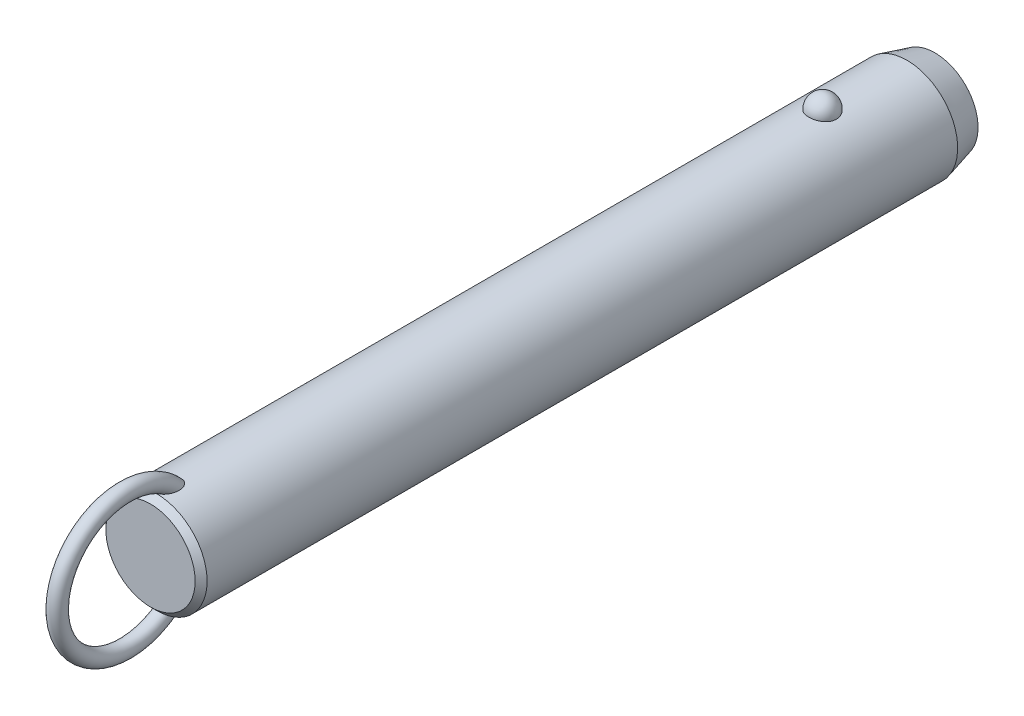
ISO-10303-21;
HEADER;
FILE_DESCRIPTION(('STEP AP214'),'2;1');
FILE_NAME('part.step','',(''),(''),'','','');
FILE_SCHEMA(('AUTOMOTIVE_DESIGN { 1 0 10303 214 1 1 1 1 }'));
ENDSEC;
DATA;
#1=APPLICATION_CONTEXT('core data for automotive mechanical design processes');
#2=APPLICATION_PROTOCOL_DEFINITION('international standard','automotive_design',2000,#1);
#3=PRODUCT_CONTEXT('',#1,'mechanical');
#4=PRODUCT('Part','Part','',(#3));
#5=PRODUCT_RELATED_PRODUCT_CATEGORY('part','',(#4));
#6=PRODUCT_DEFINITION_FORMATION('','',#4);
#7=PRODUCT_DEFINITION_CONTEXT('part definition',#1,'design');
#8=PRODUCT_DEFINITION('design','',#6,#7);
#9=PRODUCT_DEFINITION_SHAPE('','',#8);
#10=(LENGTH_UNIT() NAMED_UNIT(*) SI_UNIT(.MILLI.,.METRE.));
#11=(NAMED_UNIT(*) PLANE_ANGLE_UNIT() SI_UNIT($,.RADIAN.));
#12=(NAMED_UNIT(*) SI_UNIT($,.STERADIAN.) SOLID_ANGLE_UNIT());
#13=UNCERTAINTY_MEASURE_WITH_UNIT(LENGTH_MEASURE(1.E-05),#10,'distance_accuracy_value','');
#14=(GEOMETRIC_REPRESENTATION_CONTEXT(3) GLOBAL_UNCERTAINTY_ASSIGNED_CONTEXT((#13)) GLOBAL_UNIT_ASSIGNED_CONTEXT((#10,
#11,#12)) REPRESENTATION_CONTEXT('',''));
#15=CARTESIAN_POINT('',(0.,0.,0.));
#16=DIRECTION('',(0.,0.,1.));
#17=DIRECTION('',(1.,0.,0.));
#18=AXIS2_PLACEMENT_3D('',#15,#16,#17);
#19=CARTESIAN_POINT('',(0.,0.,152.4));
#20=DIRECTION('',(0.,0.,-1.));
#21=DIRECTION('',(-1.,0.,0.));
#22=AXIS2_PLACEMENT_3D('',#19,#20,#21);
#23=CYLINDRICAL_SURFACE('',#22,12.7);
#24=CARTESIAN_POINT('',(3.46661256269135,12.2177165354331,-3.50000000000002));
#25=CARTESIAN_POINT('',(3.4666090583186,12.2177194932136,-3.30432790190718));
#26=CARTESIAN_POINT('',(3.45063567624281,12.2222841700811,-3.10861112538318));
#27=CARTESIAN_POINT('',(3.38712451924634,12.2400345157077,-2.72271899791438));
#28=CARTESIAN_POINT('',(3.33957415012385,12.2532236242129,-2.53254588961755));
#29=CARTESIAN_POINT('',(3.2141234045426,12.286724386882,-2.16324948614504));
#30=CARTESIAN_POINT('',(3.13623639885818,12.3070329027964,-1.98412136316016));
#31=CARTESIAN_POINT('',(2.95205930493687,12.3525018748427,-1.6418059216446));
#32=CARTESIAN_POINT('',(2.84577003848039,12.3776621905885,-1.47861814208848));
#33=CARTESIAN_POINT('',(2.60688050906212,12.4301712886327,-1.17190583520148));
#34=CARTESIAN_POINT('',(2.47415697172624,12.4575299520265,-1.0284789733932));
#35=CARTESIAN_POINT('',(2.18615174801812,12.5112810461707,-0.766177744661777));
#36=CARTESIAN_POINT('',(2.03087002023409,12.5376734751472,-0.647303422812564));
#37=CARTESIAN_POINT('',(1.70237334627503,12.5864761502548,-0.437732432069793));
#38=CARTESIAN_POINT('',(1.52920948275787,12.6088972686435,-0.34695830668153));
#39=CARTESIAN_POINT('',(1.16944170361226,12.6473352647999,-0.195750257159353));
#40=CARTESIAN_POINT('',(0.982839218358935,12.663352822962,-0.135313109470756));
#41=CARTESIAN_POINT('',(0.604961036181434,12.6869706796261,-0.0473241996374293));
#42=CARTESIAN_POINT('',(0.413823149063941,12.6947125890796,-0.0192185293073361));
#43=CARTESIAN_POINT('',(0.0293827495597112,12.7014203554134,0.00517254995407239));
#44=CARTESIAN_POINT('',(-0.163919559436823,12.7003870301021,0.00146092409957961));
#45=CARTESIAN_POINT('',(-0.544374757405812,12.689735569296,-0.037393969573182));
#46=CARTESIAN_POINT('',(-0.731575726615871,12.6802364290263,-0.0721015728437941));
#47=CARTESIAN_POINT('',(-1.09733277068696,12.6538333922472,-0.171364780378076));
#48=CARTESIAN_POINT('',(-1.27588869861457,12.6369293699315,-0.235920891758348));
#49=CARTESIAN_POINT('',(-1.6204698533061,12.5973946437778,-0.393548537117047));
#50=CARTESIAN_POINT('',(-1.78641865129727,12.5747321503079,-0.486778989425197));
#51=CARTESIAN_POINT('',(-2.10030671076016,12.5261316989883,-0.699110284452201));
#52=CARTESIAN_POINT('',(-2.24824419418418,12.5001934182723,-0.818213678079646));
#53=CARTESIAN_POINT('',(-2.52491489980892,12.4472906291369,-1.0815712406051));
#54=CARTESIAN_POINT('',(-2.65324222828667,12.4203160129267,-1.22624992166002));
#55=CARTESIAN_POINT('',(-2.88410007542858,12.3687509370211,-1.53528325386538));
#56=CARTESIAN_POINT('',(-2.98662883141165,12.3441606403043,-1.69963924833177));
#57=CARTESIAN_POINT('',(-3.16432417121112,12.2998199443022,-2.04548497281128));
#58=CARTESIAN_POINT('',(-3.23917525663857,12.2801261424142,-2.22714424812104));
#59=CARTESIAN_POINT('',(-3.35800573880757,12.248167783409,-2.60091389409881));
#60=CARTESIAN_POINT('',(-3.4019860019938,12.2359030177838,-2.79302397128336));
#61=CARTESIAN_POINT('',(-3.45784812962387,12.2202347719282,-3.18140279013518));
#62=CARTESIAN_POINT('',(-3.46986123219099,12.2167950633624,-3.37765118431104));
#63=CARTESIAN_POINT('',(-3.46186273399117,12.2190638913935,-3.76943689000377));
#64=CARTESIAN_POINT('',(-3.44185196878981,12.2247721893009,-3.96497421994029));
#65=CARTESIAN_POINT('',(-3.37048652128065,12.2446381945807,-4.34881728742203));
#66=CARTESIAN_POINT('',(-3.31928253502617,12.2587552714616,-4.53715319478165));
#67=CARTESIAN_POINT('',(-3.18693461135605,12.2938237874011,-4.9023172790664));
#68=CARTESIAN_POINT('',(-3.1057895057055,12.3147754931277,-5.07914500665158));
#69=CARTESIAN_POINT('',(-2.91506431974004,12.3613125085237,-5.41732059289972));
#70=CARTESIAN_POINT('',(-2.80533587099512,12.3869217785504,-5.57858147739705));
#71=CARTESIAN_POINT('',(-2.560414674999,12.4398525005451,-5.88013283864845));
#72=CARTESIAN_POINT('',(-2.42522099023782,12.4671740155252,-6.02042254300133));
#73=CARTESIAN_POINT('',(-2.1323357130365,12.5205965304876,-6.27662798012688));
#74=CARTESIAN_POINT('',(-1.97456596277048,12.5466928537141,-6.39245542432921));
#75=CARTESIAN_POINT('',(-1.64115839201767,12.5946384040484,-6.59583547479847));
#76=CARTESIAN_POINT('',(-1.46552179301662,12.6164879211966,-6.68339001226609));
#77=CARTESIAN_POINT('',(-1.10356050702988,12.6532533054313,-6.82682153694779));
#78=CARTESIAN_POINT('',(-0.917391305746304,12.6682500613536,-6.88306988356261));
#79=CARTESIAN_POINT('',(-0.537836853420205,12.6900288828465,-6.96386887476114));
#80=CARTESIAN_POINT('',(-0.344452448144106,12.6968119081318,-6.98842322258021));
#81=CARTESIAN_POINT('',(0.0402577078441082,12.7013667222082,-7.00496469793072));
#82=CARTESIAN_POINT('',(0.231556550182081,12.6993008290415,-6.99753844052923));
#83=CARTESIAN_POINT('',(0.610105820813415,12.6867505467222,-6.95166366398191));
#84=CARTESIAN_POINT('',(0.797356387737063,12.6762664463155,-6.91321620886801));
#85=CARTESIAN_POINT('',(1.16186657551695,12.6480587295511,-6.80658431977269));
#86=CARTESIAN_POINT('',(1.33915951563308,12.6303611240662,-6.73850666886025));
#87=CARTESIAN_POINT('',(1.67968518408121,12.5896027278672,-6.57450875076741));
#88=CARTESIAN_POINT('',(1.84291705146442,12.5665416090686,-6.47858678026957));
#89=CARTESIAN_POINT('',(2.15340192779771,12.5171072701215,-6.25982455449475));
#90=CARTESIAN_POINT('',(2.30037831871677,12.4906895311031,-6.13660186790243));
#91=CARTESIAN_POINT('',(2.5717412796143,12.4376567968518,-5.86739587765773));
#92=CARTESIAN_POINT('',(2.69612388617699,12.4110417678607,-5.72140858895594));
#93=CARTESIAN_POINT('',(2.92107785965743,12.360051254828,-5.40794137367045));
#94=CARTESIAN_POINT('',(3.02121329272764,12.3357209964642,-5.24014110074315));
#95=CARTESIAN_POINT('',(3.19236291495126,12.2925446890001,-4.88969865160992));
#96=CARTESIAN_POINT('',(3.26338839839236,12.2736965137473,-4.70706226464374));
#97=CARTESIAN_POINT('',(3.36788038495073,12.245404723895,-4.35469510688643));
#98=CARTESIAN_POINT('',(3.40484026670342,12.2351018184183,-4.18605935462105));
#99=CARTESIAN_POINT('',(3.45420764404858,12.2212564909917,-3.84496058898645));
#100=CARTESIAN_POINT('',(3.46661565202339,12.2177139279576,-3.67249765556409));
#101=CARTESIAN_POINT('',(3.46661256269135,12.2177165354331,-3.50000000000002));
#102=B_SPLINE_CURVE_WITH_KNOTS('',3,(#24,#25,#26,#27,#28,#29,#30,#31,#32,#33,#34,#35,#36,#37,
#38,#39,#40,#41,#42,#43,#44,#45,#46,#47,#48,#49,#50,#51,#52,#53,#54,#55,#56,#57,#58,#59,#60,#61,
#62,#63,#64,#65,#66,#67,#68,#69,#70,#71,#72,#73,#74,#75,#76,#77,#78,#79,#80,#81,#82,#83,#84,#85,
#86,#87,#88,#89,#90,#91,#92,#93,#94,#95,#96,#97,#98,#99,#100,#101),.UNSPECIFIED.,.T.,.F.,(4,2,2,
2,2,2,2,2,2,2,2,2,2,2,2,2,2,2,2,2,2,2,2,2,2,2,2,2,2,2,2,2,2,2,2,2,2,2,4),(0.,0.586396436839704,
1.17302689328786,1.7593990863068,2.34575431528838,2.93491084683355,3.52406845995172,
4.11158733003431,4.69904375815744,5.2762784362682,5.85345931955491,6.42265312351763,
6.99185659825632,7.56427334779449,8.136746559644,8.71981013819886,9.3029135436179,
9.89247258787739,10.4820150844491,11.0691335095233,11.6562366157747,12.2405256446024,
12.8248374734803,13.412244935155,13.9996740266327,14.5891883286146,15.1786623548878,
15.7609861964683,16.3432419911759,16.914863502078,17.4864654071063,18.056024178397,
18.6256177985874,19.2037609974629,19.7820055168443,20.3699810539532,20.9577282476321,
21.4746855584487,21.9916320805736),.UNSPECIFIED.);
#103=CARTESIAN_POINT('',(3.46661256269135,12.2177165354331,-3.50000000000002));
#104=VERTEX_POINT('',#103);
#105=EDGE_CURVE('E41',#104,#104,#102,.T.);
#106=ORIENTED_EDGE('',*,*,#105,.T.);
#107=EDGE_LOOP('',(#106));
#108=FACE_BOUND('',#107,.T.);
#109=CARTESIAN_POINT('',(0.,0.,163.6));
#110=DIRECTION('',(0.,0.,1.));
#111=DIRECTION('',(1.,0.,0.));
#112=AXIS2_PLACEMENT_3D('',#109,#110,#111);
#113=CIRCLE('',#112,12.7);
#114=CARTESIAN_POINT('',(12.7,0.,163.6));
#115=VERTEX_POINT('',#114);
#116=EDGE_CURVE('E10',#115,#115,#113,.F.);
#117=ORIENTED_EDGE('',*,*,#116,.T.);
#118=EDGE_LOOP('',(#117));
#119=FACE_BOUND('',#118,.T.);
#120=CARTESIAN_POINT('',(-0.548122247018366,-12.6881662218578,157.343218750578));
#121=CARTESIAN_POINT('',(-0.648865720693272,-12.6838128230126,157.377926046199));
#122=CARTESIAN_POINT('',(-0.746398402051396,-12.6783867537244,157.422042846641));
#123=CARTESIAN_POINT('',(-0.932125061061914,-12.666091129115,157.526764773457));
#124=CARTESIAN_POINT('',(-1.02030388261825,-12.6592192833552,157.587396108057));
#125=CARTESIAN_POINT('',(-1.18487740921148,-12.6448747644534,157.721847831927));
#126=CARTESIAN_POINT('',(-1.26134296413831,-12.637406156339,157.795582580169));
#127=CARTESIAN_POINT('',(-1.4023120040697,-12.6225412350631,157.953604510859));
#128=CARTESIAN_POINT('',(-1.466814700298,-12.6151449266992,158.03789238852));
#129=CARTESIAN_POINT('',(-1.60714786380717,-12.5981718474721,158.249657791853));
#130=CARTESIAN_POINT('',(-1.67725126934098,-12.588900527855,158.380962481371));
#131=CARTESIAN_POINT('',(-1.79536591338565,-12.5725964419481,158.653247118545));
#132=CARTESIAN_POINT('',(-1.84333535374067,-12.5655679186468,158.794244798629));
#133=CARTESIAN_POINT('',(-1.93422576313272,-12.5519624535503,159.137645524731));
#134=CARTESIAN_POINT('',(-1.96788773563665,-12.5466298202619,159.342557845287));
#135=CARTESIAN_POINT('',(-1.9941399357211,-12.542463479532,159.651760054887));
#136=CARTESIAN_POINT('',(-1.99883864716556,-12.5417153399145,159.755298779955));
#137=CARTESIAN_POINT('',(-2.00078003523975,-12.5414074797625,159.96245124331));
#138=CARTESIAN_POINT('',(-1.99802449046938,-12.5418474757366,160.066064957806));
#139=CARTESIAN_POINT('',(-1.98336733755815,-12.5441750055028,160.31032076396));
#140=CARTESIAN_POINT('',(-1.96851430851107,-12.5465291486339,160.450780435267));
#141=CARTESIAN_POINT('',(-1.92707089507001,-12.5529612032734,160.729960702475));
#142=CARTESIAN_POINT('',(-1.90047458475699,-12.5570399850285,160.868680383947));
#143=CARTESIAN_POINT('',(-1.83619120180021,-12.5666008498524,161.14341135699));
#144=CARTESIAN_POINT('',(-1.79850828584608,-12.57208240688,161.279423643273));
#145=CARTESIAN_POINT('',(-1.71223796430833,-12.5841228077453,161.547842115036));
#146=CARTESIAN_POINT('',(-1.66365679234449,-12.5906810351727,161.680250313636));
#147=CARTESIAN_POINT('',(-1.57804503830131,-12.6016176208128,161.88548877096));
#148=CARTESIAN_POINT('',(-1.54477252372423,-12.6057501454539,161.959914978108));
#149=CARTESIAN_POINT('',(-1.47424480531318,-12.6141930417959,162.106839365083));
#150=CARTESIAN_POINT('',(-1.43699041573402,-12.6185033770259,162.179337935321));
#151=CARTESIAN_POINT('',(-1.35825795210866,-12.6272207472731,162.321892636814));
#152=CARTESIAN_POINT('',(-1.31678520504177,-12.6316276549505,162.391951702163));
#153=CARTESIAN_POINT('',(-1.22917793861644,-12.6404532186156,162.529070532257));
#154=CARTESIAN_POINT('',(-1.18304514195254,-12.6448718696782,162.596131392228));
#155=CARTESIAN_POINT('',(-1.07246411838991,-12.6547893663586,162.743874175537));
#156=CARTESIAN_POINT('',(-1.0064223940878,-12.6602600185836,162.823384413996));
#157=CARTESIAN_POINT('',(-0.864441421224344,-12.6707460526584,162.973169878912));
#158=CARTESIAN_POINT('',(-0.788516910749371,-12.6757620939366,163.043458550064));
#159=CARTESIAN_POINT('',(-0.652215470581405,-12.6833591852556,163.148680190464));
#160=CARTESIAN_POINT('',(-0.594982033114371,-12.6861973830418,163.187624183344));
#161=CARTESIAN_POINT('',(-0.475269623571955,-12.6912445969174,163.256489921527));
#162=CARTESIAN_POINT('',(-0.412800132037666,-12.6934547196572,163.286427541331));
#163=CARTESIAN_POINT('',(-0.295749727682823,-12.6966636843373,163.329756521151));
#164=CARTESIAN_POINT('',(-0.2419499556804,-12.6978134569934,163.345218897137));
#165=CARTESIAN_POINT('',(-0.132508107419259,-12.6994261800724,163.366884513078));
#166=CARTESIAN_POINT('',(-0.0768679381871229,-12.6998898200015,163.373097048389));
#167=CARTESIAN_POINT('',(0.0347696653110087,-12.7000752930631,163.375583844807));
#168=CARTESIAN_POINT('',(0.0907676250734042,-12.6997954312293,163.371835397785));
#169=CARTESIAN_POINT('',(0.201283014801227,-12.6985255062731,163.354788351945));
#170=CARTESIAN_POINT('',(0.255799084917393,-12.6975348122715,163.341481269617));
#171=CARTESIAN_POINT('',(0.376042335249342,-12.6946091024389,163.30203792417));
#172=CARTESIAN_POINT('',(0.440950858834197,-12.6924943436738,163.273449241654));
#173=CARTESIAN_POINT('',(0.56535027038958,-12.6875639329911,163.206323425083));
#174=CARTESIAN_POINT('',(0.624828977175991,-12.6847467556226,163.167764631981));
#175=CARTESIAN_POINT('',(0.774116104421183,-12.6767252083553,163.056949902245));
#176=CARTESIAN_POINT('',(0.859449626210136,-12.6711344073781,162.978760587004));
#177=CARTESIAN_POINT('',(1.01789440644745,-12.6593922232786,162.810943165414));
#178=CARTESIAN_POINT('',(1.09096902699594,-12.653239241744,162.721282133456));
#179=CARTESIAN_POINT('',(1.22268793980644,-12.6411674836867,162.540265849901));
#180=CARTESIAN_POINT('',(1.28193986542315,-12.6352572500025,162.449345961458));
#181=CARTESIAN_POINT('',(1.39259777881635,-12.6235401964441,162.262792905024));
#182=CARTESIAN_POINT('',(1.44399707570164,-12.6177334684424,162.167155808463));
#183=CARTESIAN_POINT('',(1.53972870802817,-12.6064093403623,161.972273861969));
#184=CARTESIAN_POINT('',(1.58405262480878,-12.6008922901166,161.873024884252));
#185=CARTESIAN_POINT('',(1.66600705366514,-12.5903187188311,161.671772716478));
#186=CARTESIAN_POINT('',(1.70363651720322,-12.5852622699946,161.569769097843));
#187=CARTESIAN_POINT('',(1.77545379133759,-12.5753406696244,161.354358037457));
#188=CARTESIAN_POINT('',(1.80903453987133,-12.5705328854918,161.240745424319));
#189=CARTESIAN_POINT('',(1.86844163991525,-12.5618400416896,161.011457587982));
#190=CARTESIAN_POINT('',(1.89426665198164,-12.5579551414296,160.895782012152));
#191=CARTESIAN_POINT('',(1.93785464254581,-12.5513030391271,160.663007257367));
#192=CARTESIAN_POINT('',(1.95562640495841,-12.5485346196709,160.545909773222));
#193=CARTESIAN_POINT('',(1.98264463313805,-12.5442934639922,160.310747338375));
#194=CARTESIAN_POINT('',(1.99189298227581,-12.5428204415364,160.19268260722));
#195=CARTESIAN_POINT('',(2.00416068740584,-12.540871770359,159.880622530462));
#196=CARTESIAN_POINT('',(1.99944433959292,-12.541631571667,159.686229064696));
#197=CARTESIAN_POINT('',(1.96113755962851,-12.5476846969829,159.300309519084));
#198=CARTESIAN_POINT('',(1.92758341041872,-12.5529723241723,159.108780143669));
#199=CARTESIAN_POINT('',(1.83934342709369,-12.5661532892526,158.782272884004));
#200=CARTESIAN_POINT('',(1.79215440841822,-12.5730485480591,158.64524997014));
#201=CARTESIAN_POINT('',(1.67676242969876,-12.588958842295,158.380445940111));
#202=CARTESIAN_POINT('',(1.60859050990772,-12.597970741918,158.252651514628));
#203=CARTESIAN_POINT('',(1.46583832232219,-12.6152829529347,158.035800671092));
#204=CARTESIAN_POINT('',(1.39525727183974,-12.6233659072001,157.94410500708));
#205=CARTESIAN_POINT('',(1.23992594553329,-12.6395676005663,157.773485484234));
#206=CARTESIAN_POINT('',(1.15517932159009,-12.6476863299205,157.694558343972));
#207=CARTESIAN_POINT('',(0.971995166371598,-12.6630846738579,157.552643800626));
#208=CARTESIAN_POINT('',(0.873456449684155,-12.6703572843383,157.489784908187));
#209=CARTESIAN_POINT('',(0.665847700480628,-12.6829569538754,157.384487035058));
#210=CARTESIAN_POINT('',(0.556784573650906,-12.688285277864,157.342034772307));
#211=CARTESIAN_POINT('',(0.347338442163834,-12.6956226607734,157.284443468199));
#212=CARTESIAN_POINT('',(0.247759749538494,-12.6979816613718,157.266399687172));
#213=CARTESIAN_POINT('',(0.0470218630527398,-12.7003077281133,157.248600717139));
#214=CARTESIAN_POINT('',(-0.0541350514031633,-12.7002779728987,157.248821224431));
#215=CARTESIAN_POINT('',(-0.221414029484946,-12.6982482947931,157.264363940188));
#216=CARTESIAN_POINT('',(-0.288055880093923,-12.6969033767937,157.274666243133));
#217=CARTESIAN_POINT('',(-0.419599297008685,-12.6932369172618,157.30313489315));
#218=CARTESIAN_POINT('',(-0.484501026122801,-12.6909154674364,157.321300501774));
#219=CARTESIAN_POINT('',(-0.548122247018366,-12.6881662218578,157.343218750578));
#220=B_SPLINE_CURVE_WITH_KNOTS('',3,(#120,#121,#122,#123,#124,#125,#126,#127,#128,#129,#130,
#131,#132,#133,#134,#135,#136,#137,#138,#139,#140,#141,#142,#143,#144,#145,#146,#147,#148,#149,
#150,#151,#152,#153,#154,#155,#156,#157,#158,#159,#160,#161,#162,#163,#164,#165,#166,#167,#168,
#169,#170,#171,#172,#173,#174,#175,#176,#177,#178,#179,#180,#181,#182,#183,#184,#185,#186,#187,
#188,#189,#190,#191,#192,#193,#194,#195,#196,#197,#198,#199,#200,#201,#202,#203,#204,#205,#206,
#207,#208,#209,#210,#211,#212,#213,#214,#215,#216,#217,#218,#219),.UNSPECIFIED.,.T.,.F.,(4,2,2,
2,2,2,2,2,2,2,2,2,2,2,2,2,2,2,2,2,2,2,2,2,2,2,2,2,2,2,2,2,2,2,2,2,2,2,2,2,2,2,2,2,2,2,2,2,2,4),
(0.,0.31964225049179,0.639794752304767,0.957927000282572,1.27608021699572,1.72100165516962,
2.16675988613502,2.78630021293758,3.09705782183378,3.40774128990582,3.83096358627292,
4.25439969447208,4.67767724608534,5.1007133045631,5.34550297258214,5.59024267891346,
5.83467707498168,6.07902143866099,6.38891080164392,6.69834321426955,6.90560910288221,
7.11250749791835,7.27977315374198,7.44687060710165,7.61434932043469,7.78197685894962,
7.99365544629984,8.20579780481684,8.55147335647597,8.89816429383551,9.22375138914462,
9.54961437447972,9.87586224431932,10.202161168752,10.5575872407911,10.9130746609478,
11.2681734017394,11.6231936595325,12.2046601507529,12.7853961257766,13.219164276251,
13.6522938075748,13.9989174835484,14.3454519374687,14.6946768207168,15.0436740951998,
15.3457513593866,15.6474266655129,15.8493051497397,16.0511646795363),.UNSPECIFIED.);
#221=CARTESIAN_POINT('',(-0.548122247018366,-12.6881662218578,157.343218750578));
#222=VERTEX_POINT('',#221);
#223=EDGE_CURVE('E60',#222,#222,#220,.T.);
#224=ORIENTED_EDGE('',*,*,#223,.T.);
#225=EDGE_LOOP('',(#224));
#226=FACE_BOUND('',#225,.T.);
#227=CARTESIAN_POINT('',(-0.548122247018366,12.6881662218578,157.343218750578));
#228=CARTESIAN_POINT('',(-0.459436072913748,12.6919968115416,157.312673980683));
#229=CARTESIAN_POINT('',(-0.368189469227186,12.6949996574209,157.289391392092));
#230=CARTESIAN_POINT('',(-0.183024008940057,12.6990186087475,157.258406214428));
#231=CARTESIAN_POINT('',(-0.0891049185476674,12.7000345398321,157.250704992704));
#232=CARTESIAN_POINT('',(0.0987147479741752,12.6999636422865,157.251245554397));
#233=CARTESIAN_POINT('',(0.192615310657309,12.6988761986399,157.259492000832));
#234=CARTESIAN_POINT('',(0.377658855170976,12.6947211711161,157.291551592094));
#235=CARTESIAN_POINT('',(0.468801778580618,12.6916535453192,157.315365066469));
#236=CARTESIAN_POINT('',(0.645809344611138,12.6838788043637,157.37745651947));
#237=CARTESIAN_POINT('',(0.731679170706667,12.6791733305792,157.415720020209));
#238=CARTESIAN_POINT('',(0.896315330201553,12.6686004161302,157.505120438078));
#239=CARTESIAN_POINT('',(0.975080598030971,12.6627328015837,157.556259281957));
#240=CARTESIAN_POINT('',(1.12963655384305,12.6499161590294,157.67367820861));
#241=CARTESIAN_POINT('',(1.20478673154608,12.6429194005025,157.740792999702));
#242=CARTESIAN_POINT('',(1.34448241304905,12.6288282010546,157.88522507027));
#243=CARTESIAN_POINT('',(1.40902173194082,12.621733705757,157.962548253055));
#244=CARTESIAN_POINT('',(1.55208211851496,12.6050877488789,158.159247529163));
#245=CARTESIAN_POINT('',(1.62510490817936,12.5957546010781,158.282654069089));
#246=CARTESIAN_POINT('',(1.75019044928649,12.5789823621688,158.539769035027));
#247=CARTESIAN_POINT('',(1.8022137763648,12.5715468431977,158.673496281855));
#248=CARTESIAN_POINT('',(1.90309965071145,12.5567434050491,158.998351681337));
#249=CARTESIAN_POINT('',(1.94342317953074,12.5504515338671,159.192161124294));
#250=CARTESIAN_POINT('',(1.99332997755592,12.5426147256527,159.58378810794));
#251=CARTESIAN_POINT('',(2.00285305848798,12.5410790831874,159.781612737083));
#252=CARTESIAN_POINT('',(1.99678999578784,12.5420407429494,160.116642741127));
#253=CARTESIAN_POINT('',(1.98794117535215,12.5434564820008,160.254042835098));
#254=CARTESIAN_POINT('',(1.95865119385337,12.5480641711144,160.527639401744));
#255=CARTESIAN_POINT('',(1.93820436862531,12.5512569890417,160.663835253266));
#256=CARTESIAN_POINT('',(1.88647896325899,12.5591352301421,160.934249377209));
#257=CARTESIAN_POINT('',(1.85518800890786,12.5638223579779,161.068465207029));
#258=CARTESIAN_POINT('',(1.78217886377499,12.5743868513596,161.333936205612));
#259=CARTESIAN_POINT('',(1.74046509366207,12.5802637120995,161.465192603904));
#260=CARTESIAN_POINT('',(1.66024095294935,12.5910571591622,161.686085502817));
#261=CARTESIAN_POINT('',(1.62434772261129,12.5957535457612,161.776690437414));
#262=CARTESIAN_POINT('',(1.54709009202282,12.6054762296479,161.955512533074));
#263=CARTESIAN_POINT('',(1.50572681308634,12.6105024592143,162.043730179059));
#264=CARTESIAN_POINT('',(1.41728020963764,12.620748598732,162.216932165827));
#265=CARTESIAN_POINT('',(1.37021377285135,12.625967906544,162.301925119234));
#266=CARTESIAN_POINT('',(1.26969620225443,12.6364721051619,162.468007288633));
#267=CARTESIAN_POINT('',(1.21624929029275,12.6417569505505,162.549099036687));
#268=CARTESIAN_POINT('',(1.1030441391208,12.6521331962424,162.704702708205));
#269=CARTESIAN_POINT('',(1.04340936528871,12.657226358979,162.779303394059));
#270=CARTESIAN_POINT('',(0.91591933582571,12.667090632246,162.921324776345));
#271=CARTESIAN_POINT('',(0.848064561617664,12.6718617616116,162.98874589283));
#272=CARTESIAN_POINT('',(0.717035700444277,12.67987711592,163.100624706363));
#273=CARTESIAN_POINT('',(0.655526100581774,12.6832377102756,163.146997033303));
#274=CARTESIAN_POINT('',(0.525985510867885,12.6892676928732,163.229619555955));
#275=CARTESIAN_POINT('',(0.457969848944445,12.6919386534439,163.265892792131));
#276=CARTESIAN_POINT('',(0.334859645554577,12.695691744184,163.316657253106));
#277=CARTESIAN_POINT('',(0.281116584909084,12.6970073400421,163.334373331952));
#278=CARTESIAN_POINT('',(0.171425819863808,12.6989609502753,163.360642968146));
#279=CARTESIAN_POINT('',(0.115480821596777,12.699599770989,163.369207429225));
#280=CARTESIAN_POINT('',(0.00272618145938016,12.7001251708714,163.376253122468));
#281=CARTESIAN_POINT('',(-0.0540859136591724,12.7000089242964,163.374696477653));
#282=CARTESIAN_POINT('',(-0.16654462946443,12.6990328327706,163.361600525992));
#283=CARTESIAN_POINT('',(-0.222190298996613,12.6981724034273,163.350053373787));
#284=CARTESIAN_POINT('',(-0.342018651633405,12.695562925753,163.314912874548));
#285=CARTESIAN_POINT('',(-0.405606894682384,12.6936676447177,163.28933225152));
#286=CARTESIAN_POINT('',(-0.527815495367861,12.6891754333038,163.228311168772));
#287=CARTESIAN_POINT('',(-0.586425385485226,12.6865770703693,163.192850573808));
#288=CARTESIAN_POINT('',(-0.731842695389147,12.6792129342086,163.091496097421));
#289=CARTESIAN_POINT('',(-0.814709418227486,12.6740767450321,163.0200395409));
#290=CARTESIAN_POINT('',(-0.969101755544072,12.6632083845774,162.86589007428));
#291=CARTESIAN_POINT('',(-1.04059564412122,12.6574746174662,162.783166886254));
#292=CARTESIAN_POINT('',(-1.16981116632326,12.6461638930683,162.615809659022));
#293=CARTESIAN_POINT('',(-1.22811369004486,12.6405994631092,162.531616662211));
#294=CARTESIAN_POINT('',(-1.33743405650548,12.6295007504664,162.358579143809));
#295=CARTESIAN_POINT('',(-1.38844577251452,12.6239664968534,162.269730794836));
#296=CARTESIAN_POINT('',(-1.48400702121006,12.6130898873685,162.088389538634));
#297=CARTESIAN_POINT('',(-1.52854232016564,12.6077479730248,161.995889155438));
#298=CARTESIAN_POINT('',(-1.61150113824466,12.5974127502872,161.808160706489));
#299=CARTESIAN_POINT('',(-1.64992317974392,12.5924195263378,161.712931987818));
#300=CARTESIAN_POINT('',(-1.73468589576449,12.581070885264,161.48289362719));
#301=CARTESIAN_POINT('',(-1.77831261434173,12.5749388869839,161.347066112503));
#302=CARTESIAN_POINT('',(-1.85439734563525,12.5639437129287,161.072212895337));
#303=CARTESIAN_POINT('',(-1.88684994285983,12.5590811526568,160.933185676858));
#304=CARTESIAN_POINT('',(-1.94008483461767,12.550968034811,160.65309235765));
#305=CARTESIAN_POINT('',(-1.96088706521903,12.5477147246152,160.512030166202));
#306=CARTESIAN_POINT('',(-1.99000539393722,12.5431291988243,160.228668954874));
#307=CARTESIAN_POINT('',(-1.99832911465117,12.5417958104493,160.086370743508));
#308=CARTESIAN_POINT('',(-2.00166624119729,12.5412674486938,159.757627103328));
#309=CARTESIAN_POINT('',(-1.99178843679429,12.5428579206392,159.571088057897));
#310=CARTESIAN_POINT('',(-1.94455183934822,12.5502731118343,159.20162404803));
#311=CARTESIAN_POINT('',(-1.90724032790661,12.5560905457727,159.018693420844));
#312=CARTESIAN_POINT('',(-1.81330718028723,12.5699462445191,158.704848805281));
#313=CARTESIAN_POINT('',(-1.76338820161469,12.5771273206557,158.571910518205));
#314=CARTESIAN_POINT('',(-1.64305018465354,12.593414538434,158.315681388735));
#315=CARTESIAN_POINT('',(-1.57265346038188,12.6025185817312,158.192380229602));
#316=CARTESIAN_POINT('',(-1.42634956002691,12.6198178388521,157.983564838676));
#317=CARTESIAN_POINT('',(-1.35423772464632,12.6278405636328,157.895384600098));
#318=CARTESIAN_POINT('',(-1.19645664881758,12.6437632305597,157.732107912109));
#319=CARTESIAN_POINT('',(-1.1108053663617,12.6516633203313,157.656994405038));
#320=CARTESIAN_POINT('',(-0.947219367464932,12.6648319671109,157.537811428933));
#321=CARTESIAN_POINT('',(-0.871624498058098,12.670300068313,157.490541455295));
#322=CARTESIAN_POINT('',(-0.714161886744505,12.6801492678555,157.4077413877));
#323=CARTESIAN_POINT('',(-0.632295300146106,12.684530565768,157.37220913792));
#324=CARTESIAN_POINT('',(-0.548122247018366,12.6881662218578,157.343218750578));
#325=B_SPLINE_CURVE_WITH_KNOTS('',3,(#227,#228,#229,#230,#231,#232,#233,#234,#235,#236,#237,
#238,#239,#240,#241,#242,#243,#244,#245,#246,#247,#248,#249,#250,#251,#252,#253,#254,#255,#256,
#257,#258,#259,#260,#261,#262,#263,#264,#265,#266,#267,#268,#269,#270,#271,#272,#273,#274,#275,
#276,#277,#278,#279,#280,#281,#282,#283,#284,#285,#286,#287,#288,#289,#290,#291,#292,#293,#294,
#295,#296,#297,#298,#299,#300,#301,#302,#303,#304,#305,#306,#307,#308,#309,#310,#311,#312,#313,
#314,#315,#316,#317,#318,#319,#320,#321,#322,#323,#324),.UNSPECIFIED.,.T.,.F.,(4,2,2,2,2,2,2,2,
2,2,2,2,2,2,2,2,2,2,2,2,2,2,2,2,2,2,2,2,2,2,2,2,2,2,2,2,2,2,2,2,2,2,2,2,2,2,2,2,4),(0.,
0.281328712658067,0.562682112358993,0.844117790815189,1.12555942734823,1.40671982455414,
1.68792232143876,1.98972294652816,2.29169886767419,2.72039860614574,3.14989948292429,
3.74084916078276,4.33295293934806,4.74554109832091,5.15833092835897,5.57159335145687,
5.98468079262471,6.27722775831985,6.56971484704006,6.86135609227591,7.15280542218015,
7.43927407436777,7.72572595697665,7.95635862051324,8.18646071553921,8.35559393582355,
8.52452541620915,8.69408946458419,8.86378678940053,9.06834348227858,9.27332014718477,
9.6001041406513,9.92778432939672,10.2350252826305,10.5425229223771,10.8506864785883,
11.15892440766,11.5867893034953,12.0148612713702,12.4421984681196,12.8692745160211,
13.4279365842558,13.9856380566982,14.4107062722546,14.835313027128,15.1765567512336,
15.517351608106,15.7844129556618,16.051425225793),.UNSPECIFIED.);
#326=CARTESIAN_POINT('',(-0.548122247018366,12.6881662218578,157.343218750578));
#327=VERTEX_POINT('',#326);
#328=EDGE_CURVE('E68',#327,#327,#325,.T.);
#329=ORIENTED_EDGE('',*,*,#328,.T.);
#330=EDGE_LOOP('',(#329));
#331=FACE_BOUND('',#330,.T.);
#332=CARTESIAN_POINT('',(0.,0.,-24.7000000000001));
#333=DIRECTION('',(0.,0.,-1.));
#334=DIRECTION('',(-1.,0.,0.));
#335=AXIS2_PLACEMENT_3D('',#332,#333,#334);
#336=CIRCLE('',#335,12.7);
#337=CARTESIAN_POINT('',(-12.7,0.,-24.7000000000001));
#338=VERTEX_POINT('',#337);
#339=EDGE_CURVE('E57',#338,#338,#336,.F.);
#340=ORIENTED_EDGE('',*,*,#339,.T.);
#341=EDGE_LOOP('',(#340));
#342=FACE_BOUND('',#341,.T.);
#343=ADVANCED_FACE('F37',(#108,#119,#226,#331,#342),#23,.T.);
#344=CARTESIAN_POINT('',(0.,0.,-31.7));
#345=DIRECTION('',(0.,0.,-1.));
#346=DIRECTION('',(-1.,0.,0.));
#347=AXIS2_PLACEMENT_3D('',#344,#345,#346);
#348=PLANE('',#347);
#349=CARTESIAN_POINT('',(0.,0.,-31.7));
#350=DIRECTION('',(0.,0.,-1.));
#351=DIRECTION('',(-1.,0.,0.));
#352=AXIS2_PLACEMENT_3D('',#349,#350,#351);
#353=CIRCLE('',#352,10.8243556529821);
#354=CARTESIAN_POINT('',(-10.8243556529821,0.,-31.7));
#355=VERTEX_POINT('',#354);
#356=EDGE_CURVE('E67',#355,#355,#353,.T.);
#357=ORIENTED_EDGE('',*,*,#356,.T.);
#358=EDGE_LOOP('',(#357));
#359=FACE_BOUND('',#358,.T.);
#360=ADVANCED_FACE('F86',(#359),#348,.T.);
#361=CARTESIAN_POINT('',(0.,0.,-31.7));
#362=DIRECTION('',(0.,0.,1.));
#363=DIRECTION('',(1.,0.,0.));
#364=AXIS2_PLACEMENT_3D('',#361,#362,#363);
#365=CONICAL_SURFACE('',#364,10.8243556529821,0.261799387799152);
#366=ORIENTED_EDGE('',*,*,#339,.F.);
#367=EDGE_LOOP('',(#366));
#368=FACE_BOUND('',#367,.T.);
#369=ORIENTED_EDGE('',*,*,#356,.F.);
#370=EDGE_LOOP('',(#369));
#371=FACE_BOUND('',#370,.T.);
#372=ADVANCED_FACE('F84',(#368,#371),#365,.T.);
#373=CARTESIAN_POINT('',(0.,0.,165.1));
#374=DIRECTION('',(0.,0.,1.));
#375=DIRECTION('',(1.,0.,0.));
#376=AXIS2_PLACEMENT_3D('',#373,#374,#375);
#377=PLANE('',#376);
#378=CARTESIAN_POINT('',(0.,0.,165.1));
#379=DIRECTION('',(0.,0.,1.));
#380=DIRECTION('',(1.,0.,0.));
#381=AXIS2_PLACEMENT_3D('',#378,#379,#380);
#382=CIRCLE('',#381,11.2000000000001);
#383=CARTESIAN_POINT('',(11.2000000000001,0.,165.1));
#384=VERTEX_POINT('',#383);
#385=EDGE_CURVE('E50',#384,#384,#382,.T.);
#386=ORIENTED_EDGE('',*,*,#385,.T.);
#387=EDGE_LOOP('',(#386));
#388=FACE_BOUND('',#387,.T.);
#389=ADVANCED_FACE('F78',(#388),#377,.T.);
#390=CARTESIAN_POINT('',(0.,0.,171.45));
#391=DIRECTION('',(1.,0.,0.));
#392=DIRECTION('',(0.,0.,-1.));
#393=AXIS2_PLACEMENT_3D('',#390,#391,#392);
#394=TOROIDAL_SURFACE('',#393,17.05,2.);
#395=ORIENTED_EDGE('',*,*,#328,.F.);
#396=EDGE_LOOP('',(#395));
#397=FACE_BOUND('',#396,.T.);
#398=ORIENTED_EDGE('',*,*,#223,.F.);
#399=EDGE_LOOP('',(#398));
#400=FACE_BOUND('',#399,.T.);
#401=ADVANCED_FACE('F74',(#397,#400),#394,.T.);
#402=CARTESIAN_POINT('',(0.,0.,165.1));
#403=DIRECTION('',(0.,0.,-1.));
#404=DIRECTION('',(-1.,0.,0.));
#405=AXIS2_PLACEMENT_3D('',#402,#403,#404);
#406=CONICAL_SURFACE('',#405,11.2000000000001,0.785398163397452);
#407=ORIENTED_EDGE('',*,*,#116,.F.);
#408=EDGE_LOOP('',(#407));
#409=FACE_BOUND('',#408,.T.);
#410=ORIENTED_EDGE('',*,*,#385,.F.);
#411=EDGE_LOOP('',(#410));
#412=FACE_BOUND('',#411,.T.);
#413=ADVANCED_FACE('F39',(#409,#412),#406,.T.);
#414=CARTESIAN_POINT('',(0.,12.7,-3.50000000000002));
#415=DIRECTION('',(0.,1.,0.));
#416=DIRECTION('',(0.,0.,-1.));
#417=AXIS2_PLACEMENT_3D('',#414,#415,#416);
#418=SPHERICAL_SURFACE('',#417,3.5);
#419=ORIENTED_EDGE('',*,*,#105,.F.);
#420=EDGE_LOOP('',(#419));
#421=FACE_BOUND('',#420,.T.);
#422=ADVANCED_FACE('F80',(#421),#418,.T.);
#423=CLOSED_SHELL('',(#343,#360,#372,#389,#401,#413,#422));
#424=MANIFOLD_SOLID_BREP('B2',#423);
#425=ADVANCED_BREP_SHAPE_REPRESENTATION('',(#18,#424),#14);
#426=SHAPE_DEFINITION_REPRESENTATION(#9,#425);
ENDSEC;
END-ISO-10303-21;
